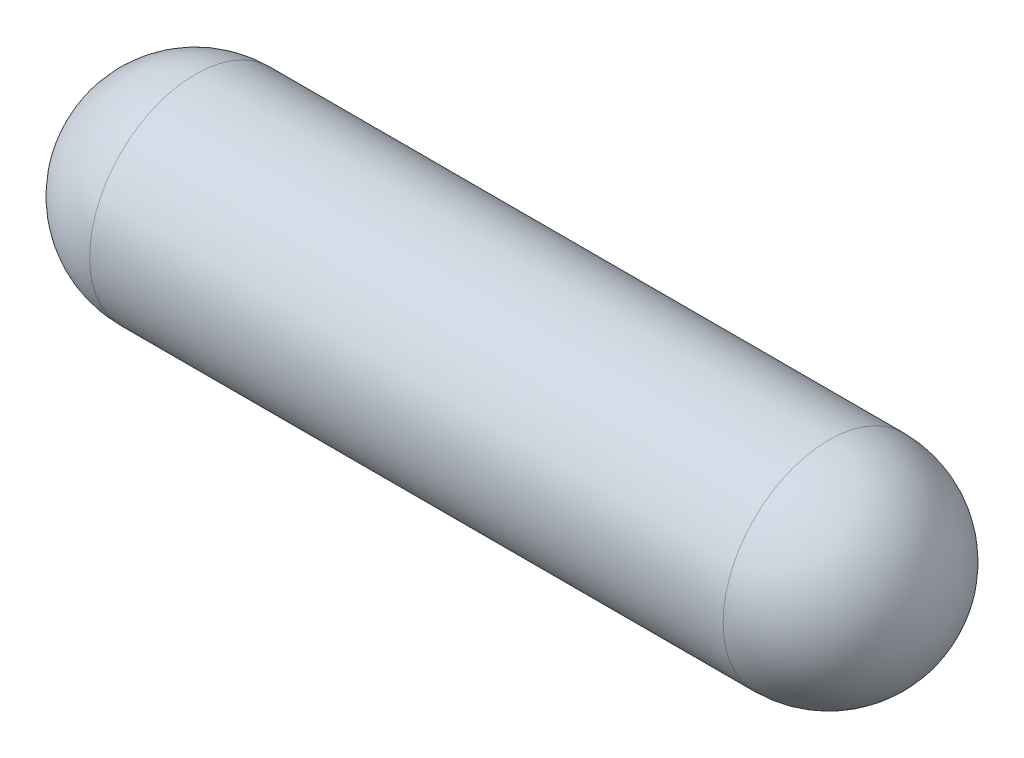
from build123d import *


with BuildPart() as part:
    # Esquisse1 → cylindre (revolve)
    with BuildSketch(Plane.XY):
        with BuildLine():
            Line((-3, 0), (3, 0))
            ThreePointArc((3, 0), (2.780330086, 0.530330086), (2.25, 0.75))
            Line((2.25, 0.75), (-2.25, 0.75))
            ThreePointArc((-2.25, 0.75), (-2.780330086, 0.530330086), (-3, 0))
        make_face()
    revolve(axis=Axis((-4, 0, 0), (1, 0, 0)))


solid = part.part
